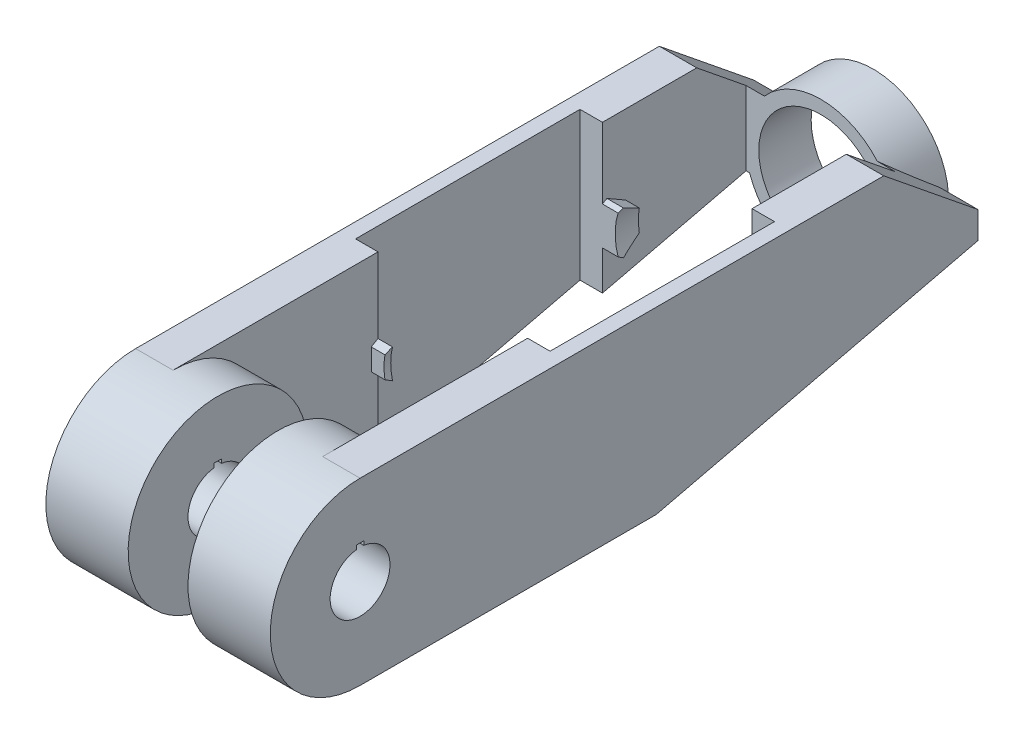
from build123d import *

# Parameters (mm, degrees)
SALIENTE_EXTRUIR1_DEPTH = 75
CORTAR_EXTRUIR1_DEPTH   = 50
CROQUIS3_R              = 20
CORTAR_EXTRUIR2_DEPTH   = 444.473787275
SALIENTE_EXTRUIR2_REACH = 437.654
CROQUIS5_R              = 60
CORTAR_EXTRUIR3_DEPTH   = 20
CROQUIS6_R              = 50.311529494
SALIENTE_EXTRUIR3_DEPTH = 30
CORTAR_EXTRUIR4_REACH   = 484.653
CROQUIS7_R              = 41.500753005
CROQUIS8_W              = 130
CROQUIS8_H              = 150
CORTAR_EXTRUIR5_DEPTH   = 437.570727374
SALIENTE_EXTRUIR4_START = 5
CROQUIS9_R              = 41.500753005
SALIENTE_EXTRUIR4_DEPTH = 5
CROQUIS10_W             = 5
CROQUIS10_H             = 5
CORTAR_EXTRUIR6_DEPTH   = 449.133908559


with BuildPart() as part:
    # Croquis1 → Saliente-Extruir1 (new, symmetric)
    with BuildSketch(Plane(origin=(0, 0, 0), x_dir=(0, 0, -1), z_dir=(1, 0, 0))):
        with BuildLine():
            Line((0, 60), (350, 60))
            Line((350, 60), (413, 8.983605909))
            Line((413, 8.983605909), (413, -8.983605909))
            Line((413, -8.983605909), (198, -60))
            Line((198, -60), (0, -60))
            ThreePointArc((0, -60), (-60, 0), (0, 60))
        make_face()
    extrude(amount=SALIENTE_EXTRUIR1_DEPTH, both=True)

    # Croquis2 → Cortar-Extruir1 (cut, symmetric)
    with BuildSketch(Plane(origin=(0, 0, 0), x_dir=(0, 0, -1), z_dir=(1, 0, 0))):
        with BuildLine():
            Line((0, -60), (198, -60))
            Line((198, -60), (383, -16.102172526))
            Line((383, -16.102172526), (383, 60))
            Line((383, 60), (0, 60))
            ThreePointArc((0, 60), (60, 0), (0, -60))
        make_face()
    extrude(amount=CORTAR_EXTRUIR1_DEPTH, both=True, mode=Mode.SUBTRACT)

    # Croquis3 → Cortar-Extruir2 (cut, through all)
    with BuildSketch(Plane(origin=(75, 0, 0), x_dir=(0, 0, -1), z_dir=(1, 0, 0))):
        Circle(CROQUIS3_R)
    extrude(amount=-CORTAR_EXTRUIR2_DEPTH, mode=Mode.SUBTRACT)

    # Croquis4 → Saliente-Extruir2 (add, up to next)
    with BuildSketch(Plane.ZY.offset(-50), mode=Mode.PRIVATE) as saliente_extruir2_sk1:
        Polygon((-132.5, -7.216878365), (-132.5, 7.216878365), (-145, 14.43375673), (-157.5, 7.216878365), (-157.5, -7.216878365), (-145, -14.43375673), align=None)
    saliente_extruir2_tool1 = extrude(saliente_extruir2_sk1.sketch, amount=SALIENTE_EXTRUIR2_REACH, mode=Mode.PRIVATE) - part.part
    # Croquis4 → Saliente-Extruir2 (add, up to next)
    with BuildSketch(Plane.ZY.offset(-50), mode=Mode.PRIVATE) as saliente_extruir2_sk2:
        Polygon((-277.5, -7.216878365), (-277.5, 7.216878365), (-290, 14.43375673), (-302.5, 7.216878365), (-302.5, -7.216878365), (-290, -14.43375673), align=None)
    saliente_extruir2_tool2 = extrude(saliente_extruir2_sk2.sketch, amount=SALIENTE_EXTRUIR2_REACH, mode=Mode.PRIVATE) - part.part
    add(saliente_extruir2_tool1.solids().sort_by_distance((50, 0, -145))[0])
    add(saliente_extruir2_tool2.solids().sort_by_distance((50, 0, -290))[0])

    # Croquis5 → Cortar-Extruir3 (cut, symmetric)
    with BuildSketch(Plane(origin=(0, 0, 0), x_dir=(0, 0, -1), z_dir=(1, 0, 0))):
        with Locations(Location((0, 0, 0), (0, 0, 270))):
            Circle(CROQUIS5_R)
    extrude(amount=CORTAR_EXTRUIR3_DEPTH, both=True, mode=Mode.SUBTRACT)

    # Croquis6 → Saliente-Extruir3 (add)
    with BuildSketch(Plane(origin=(0, 0, -413), x_dir=(-1, 0, 0), z_dir=(0, 0, -1))):
        Circle(CROQUIS6_R)
    extrude(amount=-SALIENTE_EXTRUIR3_DEPTH)

    # Cortar-Extruir4: up to this face of the body (flat: up to its plane)
    cortar_extruir4_end = Plane(part.part.faces().sort_by_distance((0, 0, -132.5))[0])
    # Croquis7 → Cortar-Extruir4 (cut, up to the picked face)
    with BuildSketch(Plane(origin=(0, 0, -413), x_dir=(-1, 0, 0), z_dir=(0, 0, -1)), mode=Mode.PRIVATE) as cortar_extruir4_sk1:
        Circle(CROQUIS7_R)
    cortar_extruir4_tool1 = split(extrude(cortar_extruir4_sk1.sketch, amount=-CORTAR_EXTRUIR4_REACH, mode=Mode.PRIVATE), bisect_by=cortar_extruir4_end, keep=Keep.BOTH, mode=Mode.PRIVATE)
    add(cortar_extruir4_tool1.solids().sort_by(Axis((0, 0, -413), (0, 0, 1)))[0], mode=Mode.SUBTRACT)

    # Croquis8 → Cortar-Extruir5 (cut, through all)
    with BuildSketch(Plane(origin=(0, 60, 0), x_dir=(1, 0, 0), z_dir=(0, 1, 0))):
        with Locations((0, 212)):
            Rectangle(CROQUIS8_W, CROQUIS8_H)
    extrude(amount=-CORTAR_EXTRUIR5_DEPTH, mode=Mode.SUBTRACT)

    # Croquis9 → Saliente-Extruir4 (add)
    with BuildSketch(Plane(origin=(0, 0, -413), x_dir=(-1, 0, 0), z_dir=(0, 0, -1)).offset(SALIENTE_EXTRUIR4_START)):
        with BuildLine():
            ThreePointArc((-49.502977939, -8.983605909), (8.983605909, -49.502977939), (49.502977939, 8.983605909))
            ThreePointArc((49.502977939, 8.983605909), (-8.983605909, 49.502977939), (-49.502977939, -8.983605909))
        make_face()
        Circle(CROQUIS9_R, mode=Mode.SUBTRACT)
    extrude(amount=-SALIENTE_EXTRUIR4_DEPTH)

    # Croquis10 → Cortar-Extruir6 (cut, through all)
    with BuildSketch(Plane(origin=(75, 0, 0), x_dir=(0, 0, -1), z_dir=(1, 0, 0))):
        with Locations((0, 20)):
            Rectangle(CROQUIS10_W, CROQUIS10_H)
    extrude(amount=-CORTAR_EXTRUIR6_DEPTH, mode=Mode.SUBTRACT)


solid = part.part
